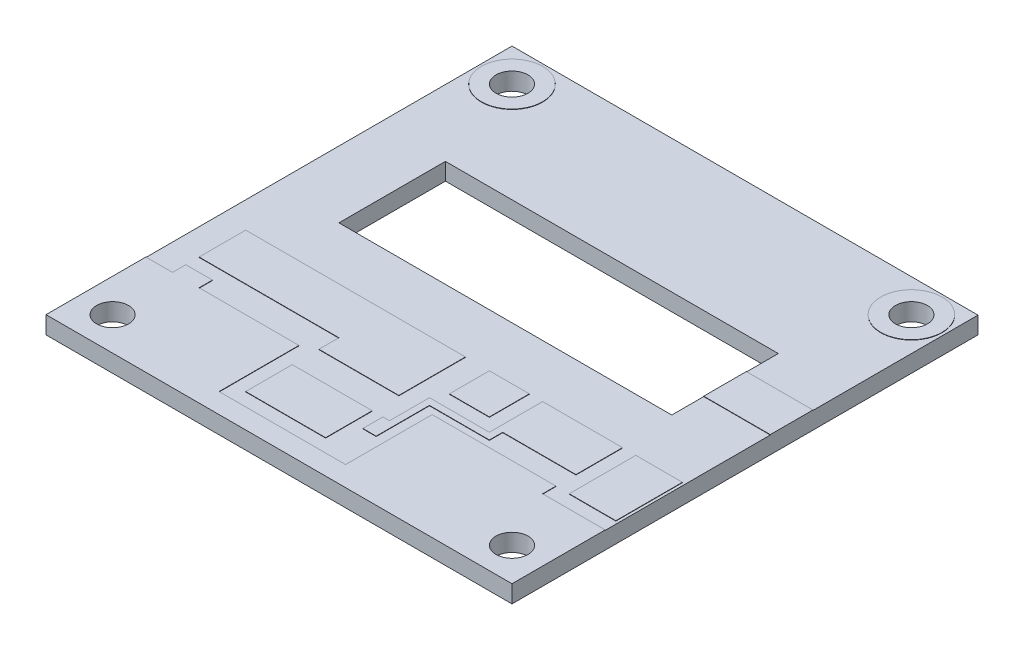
from build123d import *

# Parameters (mm, degrees)
SKETCH1_W           = 44.45
SKETCH1_H           = 44.45
BOSS_EXTRUDE1_DEPTH = 1.6002
SKETCH7_W           = 44.45
SKETCH7_H           = 44.45
BOSS_EXTRUDE3_DEPTH = 0.03556
SKETCH3_W           = 31.75
SKETCH3_H           = 10.16
CUT_EXTRUDE2_DEPTH  = 32.473432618
SKETCH10_W          = 7.62
SKETCH10_H          = 4.445
SKETCH10_W_2        = 4.445
SKETCH10_H_2        = 6.35
SKETCH10_W_3        = 3.81
SKETCH10_H_3        = 3.81
BOSS_EXTRUDE5_DEPTH = 0.03556
SKETCH34_R          = 2.921
BOSS_EXTRUDE6_DEPTH = 0.03556
SKETCH35_R          = 1.524
CUT_EXTRUDE3_DEPTH  = 32.475300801


with BuildPart() as part:
    # Sketch1 → Boss-Extrude1 (new body)
    with BuildSketch(Plane(origin=(0, 0, 0), x_dir=(1, 0, 0), z_dir=(0, 1, 0))):
        Rectangle(SKETCH1_W, SKETCH1_H)
    extrude(amount=BOSS_EXTRUDE1_DEPTH)

    # Sketch7 → Boss-Extrude3 (add)
    with BuildSketch(Plane.XZ):
        Rectangle(SKETCH7_W, SKETCH7_H)
    extrude(amount=BOSS_EXTRUDE3_DEPTH)

    # Sketch3 → Cut-Extrude2 (cut, through all)
    with BuildSketch(Plane(origin=(0, 1.6002, 0), x_dir=(1, 0, 0), z_dir=(0, 1, 0))):
        with Locations((0, 4.445)):
            Rectangle(SKETCH3_W, SKETCH3_H)
    extrude(amount=-CUT_EXTRUDE2_DEPTH, mode=Mode.SUBTRACT)

    # Sketch10 → Boss-Extrude5 (add)
    with BuildSketch(Plane(origin=(0, 1.6002, 0), x_dir=(1, 0, 0), z_dir=(0, 1, 0))):
        with Locations((-2.54, -16.8275)):
            Rectangle(SKETCH10_W, SKETCH10_H)
        Polygon((-22.225, -22.225), (-22.225, -12.7), (-19.685, -12.7), (-19.685, -11.43), (-17.145, -11.43), (-17.145, -12.7), (-7.62, -12.7), (-7.62, -20.32), (4.445, -20.32), (4.445, -12.065), (16.256, -12.065), (16.256, -13.335), (22.225, -13.335), (22.225, -22.225), align=None)
        Polygon((15.875, 4.445), (15.875, 6.477), (22.225, 6.477), (22.225, 2.413), (15.875, 2.413), align=None)
        with Locations((19.7485, -8.89)):
            Rectangle(SKETCH10_W_2, SKETCH10_H_2)
        with Locations((5.461, -7.62)):
            Rectangle(SKETCH10_W_3, SKETCH10_H_3)
        Polygon((16.256, -10.16), (16.256, -5.715), (8.636, -5.715), (8.636, -10.16), (8.636, -10.795), (2.921, -10.795), (2.921, -14.605), (2.286, -14.605), (2.286, -16.51), (3.556, -16.51), (3.556, -12.065), (3.556, -11.43), (9.271, -11.43), (9.271, -10.16), align=None)
        Polygon((-19.685, -10.16), (-19.685, -5.715), (1.27, -5.715), (1.27, -12.065), (-6.35, -12.065), (-6.35, -10.16), align=None)
    extrude(amount=BOSS_EXTRUDE5_DEPTH)

    # Sketch34 → Boss-Extrude6 (add)
    with BuildSketch(Plane(origin=(0, 1.6002, 0), x_dir=(1, 0, 0), z_dir=(0, 1, 0))):
        with Locations(Location((-19.05, 19.05, 0), (0, 0, 90))):
            Circle(SKETCH34_R)
        with Locations(Location((19.05, 19.05, 0), (0, 0, 90))):
            Circle(SKETCH34_R)
    extrude(amount=BOSS_EXTRUDE6_DEPTH)

    # Sketch35 → Cut-Extrude3 (cut, through all)
    with BuildSketch(Plane(origin=(0, 1.63576, 0), x_dir=(1, 0, 0), z_dir=(0, 1, 0))):
        with Locations(Location((-19.05, 19.05, 0), (0, 0, 270))):
            Circle(SKETCH35_R)
        with Locations(Location((19.05, 19.05, 0), (0, 0, 270))):
            Circle(SKETCH35_R)
        with Locations(Location((19.05, -19.05, 0), (0, 0, 270))):
            Circle(SKETCH35_R)
        with Locations(Location((-19.05, -19.05, 0), (0, 0, 270))):
            Circle(SKETCH35_R)
    extrude(amount=-CUT_EXTRUDE3_DEPTH, mode=Mode.SUBTRACT)


solid = part.part
